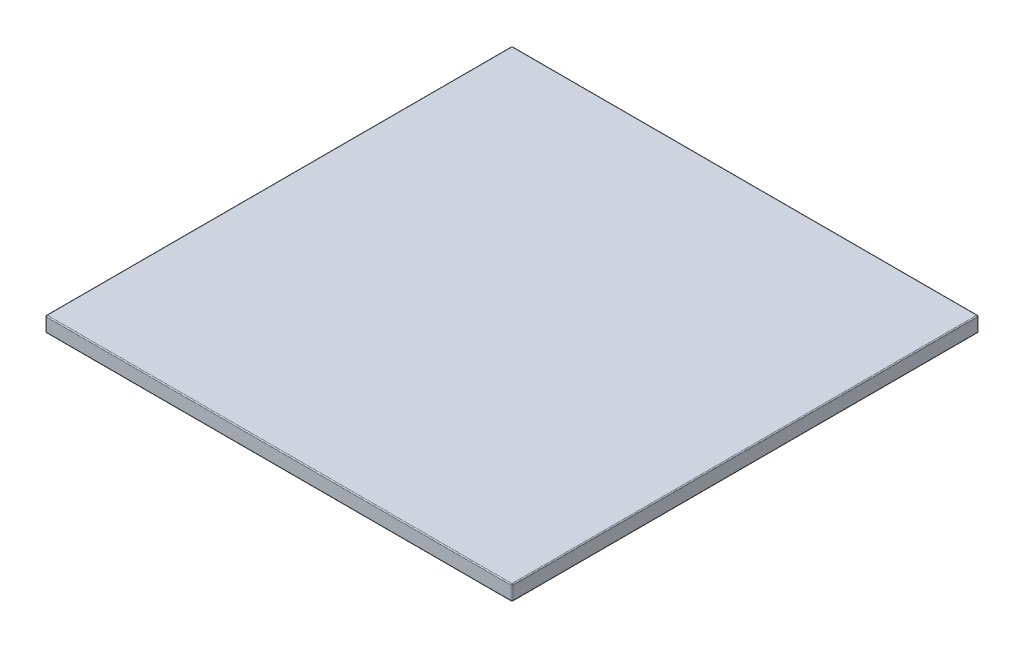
ISO-10303-21;
HEADER;
FILE_DESCRIPTION(('STEP AP214'),'2;1');
FILE_NAME('part.step','',(''),(''),'','','');
FILE_SCHEMA(('AUTOMOTIVE_DESIGN { 1 0 10303 214 1 1 1 1 }'));
ENDSEC;
DATA;
#1=APPLICATION_CONTEXT('core data for automotive mechanical design processes');
#2=APPLICATION_PROTOCOL_DEFINITION('international standard','automotive_design',2000,#1);
#3=PRODUCT_CONTEXT('',#1,'mechanical');
#4=PRODUCT('Part','Part','',(#3));
#5=PRODUCT_RELATED_PRODUCT_CATEGORY('part','',(#4));
#6=PRODUCT_DEFINITION_FORMATION('','',#4);
#7=PRODUCT_DEFINITION_CONTEXT('part definition',#1,'design');
#8=PRODUCT_DEFINITION('design','',#6,#7);
#9=PRODUCT_DEFINITION_SHAPE('','',#8);
#10=(LENGTH_UNIT() NAMED_UNIT(*) SI_UNIT(.MILLI.,.METRE.));
#11=(NAMED_UNIT(*) PLANE_ANGLE_UNIT() SI_UNIT($,.RADIAN.));
#12=(NAMED_UNIT(*) SI_UNIT($,.STERADIAN.) SOLID_ANGLE_UNIT());
#13=UNCERTAINTY_MEASURE_WITH_UNIT(LENGTH_MEASURE(1.E-05),#10,'distance_accuracy_value','');
#14=(GEOMETRIC_REPRESENTATION_CONTEXT(3) GLOBAL_UNCERTAINTY_ASSIGNED_CONTEXT((#13)) GLOBAL_UNIT_ASSIGNED_CONTEXT((#10,
#11,#12)) REPRESENTATION_CONTEXT('',''));
#15=CARTESIAN_POINT('',(0.,0.,0.));
#16=DIRECTION('',(0.,0.,1.));
#17=DIRECTION('',(1.,0.,0.));
#18=AXIS2_PLACEMENT_3D('',#15,#16,#17);
#19=CARTESIAN_POINT('',(0.,39.5,0.));
#20=DIRECTION('',(1.,0.,0.));
#21=DIRECTION('',(0.,0.,-1.));
#22=AXIS2_PLACEMENT_3D('',#19,#20,#21);
#23=PLANE('',#22);
#24=DIRECTION('',(0.,-1.,0.));
#25=VECTOR('',#24,1.);
#26=CARTESIAN_POINT('',(0.,39.5,-1216.66));
#27=LINE('',#26,#25);
#28=CARTESIAN_POINT('',(0.,36.96,-1216.66));
#29=VERTEX_POINT('',#28);
#30=CARTESIAN_POINT('',(0.,2.54,-1216.66));
#31=VERTEX_POINT('',#30);
#32=EDGE_CURVE('E136',#29,#31,#27,.T.);
#33=ORIENTED_EDGE('',*,*,#32,.T.);
#34=DIRECTION('',(0.,0.,1.));
#35=VECTOR('',#34,1.);
#36=CARTESIAN_POINT('',(0.,2.54,0.));
#37=LINE('',#36,#35);
#38=CARTESIAN_POINT('',(0.,2.54,-2.54));
#39=VERTEX_POINT('',#38);
#40=EDGE_CURVE('E177',#31,#39,#37,.T.);
#41=ORIENTED_EDGE('',*,*,#40,.T.);
#42=DIRECTION('',(0.,-1.,0.));
#43=VECTOR('',#42,1.);
#44=CARTESIAN_POINT('',(0.,39.5,-2.54));
#45=LINE('',#44,#43);
#46=CARTESIAN_POINT('',(0.,36.96,-2.54));
#47=VERTEX_POINT('',#46);
#48=EDGE_CURVE('E174',#39,#47,#45,.F.);
#49=ORIENTED_EDGE('',*,*,#48,.T.);
#50=DIRECTION('',(0.,0.,1.));
#51=VECTOR('',#50,1.);
#52=CARTESIAN_POINT('',(0.,36.96,0.));
#53=LINE('',#52,#51);
#54=EDGE_CURVE('E172',#47,#29,#53,.F.);
#55=ORIENTED_EDGE('',*,*,#54,.T.);
#56=EDGE_LOOP('',(#33,#41,#49,#55));
#57=FACE_BOUND('',#56,.T.);
#58=ADVANCED_FACE('F31',(#57),#23,.F.);
#59=CARTESIAN_POINT('',(0.,39.5,0.));
#60=DIRECTION('',(0.,0.,-1.));
#61=DIRECTION('',(-1.,0.,0.));
#62=AXIS2_PLACEMENT_3D('',#59,#60,#61);
#63=PLANE('',#62);
#64=DIRECTION('',(0.,-1.,0.));
#65=VECTOR('',#64,1.);
#66=CARTESIAN_POINT('',(2.54,39.5,0.));
#67=LINE('',#66,#65);
#68=CARTESIAN_POINT('',(2.54,36.96,0.));
#69=VERTEX_POINT('',#68);
#70=CARTESIAN_POINT('',(2.54,2.54,0.));
#71=VERTEX_POINT('',#70);
#72=EDGE_CURVE('E183',#69,#71,#67,.T.);
#73=ORIENTED_EDGE('',*,*,#72,.T.);
#74=DIRECTION('',(1.,0.,0.));
#75=VECTOR('',#74,1.);
#76=CARTESIAN_POINT('',(1219.2,2.54,0.));
#77=LINE('',#76,#75);
#78=CARTESIAN_POINT('',(1216.66,2.54,0.));
#79=VERTEX_POINT('',#78);
#80=EDGE_CURVE('E186',#71,#79,#77,.T.);
#81=ORIENTED_EDGE('',*,*,#80,.T.);
#82=DIRECTION('',(0.,-1.,0.));
#83=VECTOR('',#82,1.);
#84=CARTESIAN_POINT('',(1216.66,39.5,0.));
#85=LINE('',#84,#83);
#86=CARTESIAN_POINT('',(1216.66,36.96,0.));
#87=VERTEX_POINT('',#86);
#88=EDGE_CURVE('E181',#79,#87,#85,.F.);
#89=ORIENTED_EDGE('',*,*,#88,.T.);
#90=DIRECTION('',(1.,0.,0.));
#91=VECTOR('',#90,1.);
#92=CARTESIAN_POINT('',(0.,36.96,0.));
#93=LINE('',#92,#91);
#94=EDGE_CURVE('E179',#87,#69,#93,.F.);
#95=ORIENTED_EDGE('',*,*,#94,.T.);
#96=EDGE_LOOP('',(#73,#81,#89,#95));
#97=FACE_BOUND('',#96,.T.);
#98=ADVANCED_FACE('F307',(#97),#63,.F.);
#99=CARTESIAN_POINT('',(1219.2,39.5,0.));
#100=DIRECTION('',(-1.,0.,0.));
#101=DIRECTION('',(0.,0.,1.));
#102=AXIS2_PLACEMENT_3D('',#99,#100,#101);
#103=PLANE('',#102);
#104=DIRECTION('',(0.,-1.,0.));
#105=VECTOR('',#104,1.);
#106=CARTESIAN_POINT('',(1219.2,39.5,-2.54));
#107=LINE('',#106,#105);
#108=CARTESIAN_POINT('',(1219.2,36.96,-2.54));
#109=VERTEX_POINT('',#108);
#110=CARTESIAN_POINT('',(1219.2,2.54,-2.54));
#111=VERTEX_POINT('',#110);
#112=EDGE_CURVE('E165',#109,#111,#107,.T.);
#113=ORIENTED_EDGE('',*,*,#112,.T.);
#114=DIRECTION('',(0.,0.,-1.));
#115=VECTOR('',#114,1.);
#116=CARTESIAN_POINT('',(1219.2,2.54,-1219.2));
#117=LINE('',#116,#115);
#118=CARTESIAN_POINT('',(1219.2,2.54,-1216.66));
#119=VERTEX_POINT('',#118);
#120=EDGE_CURVE('E170',#111,#119,#117,.T.);
#121=ORIENTED_EDGE('',*,*,#120,.T.);
#122=DIRECTION('',(0.,-1.,0.));
#123=VECTOR('',#122,1.);
#124=CARTESIAN_POINT('',(1219.2,39.5,-1216.66));
#125=LINE('',#124,#123);
#126=CARTESIAN_POINT('',(1219.2,36.96,-1216.66));
#127=VERTEX_POINT('',#126);
#128=EDGE_CURVE('E167',#119,#127,#125,.F.);
#129=ORIENTED_EDGE('',*,*,#128,.T.);
#130=DIRECTION('',(0.,0.,-1.));
#131=VECTOR('',#130,1.);
#132=CARTESIAN_POINT('',(1219.2,36.96,0.));
#133=LINE('',#132,#131);
#134=EDGE_CURVE('E163',#127,#109,#133,.F.);
#135=ORIENTED_EDGE('',*,*,#134,.T.);
#136=EDGE_LOOP('',(#113,#121,#129,#135));
#137=FACE_BOUND('',#136,.T.);
#138=ADVANCED_FACE('F301',(#137),#103,.F.);
#139=CARTESIAN_POINT('',(0.,39.5,-1219.2));
#140=DIRECTION('',(0.,0.,1.));
#141=DIRECTION('',(1.,0.,0.));
#142=AXIS2_PLACEMENT_3D('',#139,#140,#141);
#143=PLANE('',#142);
#144=DIRECTION('',(0.,-1.,0.));
#145=VECTOR('',#144,1.);
#146=CARTESIAN_POINT('',(1216.66,39.5,-1219.2));
#147=LINE('',#146,#145);
#148=CARTESIAN_POINT('',(1216.66,36.96,-1219.2));
#149=VERTEX_POINT('',#148);
#150=CARTESIAN_POINT('',(1216.66,2.54,-1219.2));
#151=VERTEX_POINT('',#150);
#152=EDGE_CURVE('E128',#149,#151,#147,.T.);
#153=ORIENTED_EDGE('',*,*,#152,.T.);
#154=DIRECTION('',(-1.,0.,0.));
#155=VECTOR('',#154,1.);
#156=CARTESIAN_POINT('',(0.,2.54,-1219.2));
#157=LINE('',#156,#155);
#158=CARTESIAN_POINT('',(2.54,2.54,-1219.2));
#159=VERTEX_POINT('',#158);
#160=EDGE_CURVE('E124',#151,#159,#157,.T.);
#161=ORIENTED_EDGE('',*,*,#160,.T.);
#162=DIRECTION('',(0.,-1.,0.));
#163=VECTOR('',#162,1.);
#164=CARTESIAN_POINT('',(2.54,39.5,-1219.2));
#165=LINE('',#164,#163);
#166=CARTESIAN_POINT('',(2.54,36.96,-1219.2));
#167=VERTEX_POINT('',#166);
#168=EDGE_CURVE('E116',#159,#167,#165,.F.);
#169=ORIENTED_EDGE('',*,*,#168,.T.);
#170=DIRECTION('',(-1.,0.,0.));
#171=VECTOR('',#170,1.);
#172=CARTESIAN_POINT('',(0.,36.96,-1219.2));
#173=LINE('',#172,#171);
#174=EDGE_CURVE('E121',#167,#149,#173,.F.);
#175=ORIENTED_EDGE('',*,*,#174,.T.);
#176=EDGE_LOOP('',(#153,#161,#169,#175));
#177=FACE_BOUND('',#176,.T.);
#178=ADVANCED_FACE('F119',(#177),#143,.F.);
#179=CARTESIAN_POINT('',(0.,39.5,-1219.2));
#180=DIRECTION('',(0.,-1.,0.));
#181=DIRECTION('',(0.,0.,-1.));
#182=AXIS2_PLACEMENT_3D('',#179,#180,#181);
#183=PLANE('',#182);
#184=DIRECTION('',(0.,0.,-1.));
#185=VECTOR('',#184,1.);
#186=CARTESIAN_POINT('',(1216.66,39.5,-1219.2));
#187=LINE('',#186,#185);
#188=CARTESIAN_POINT('',(1216.66,39.5,-2.53999999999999));
#189=VERTEX_POINT('',#188);
#190=CARTESIAN_POINT('',(1216.66,39.5,-1216.66));
#191=VERTEX_POINT('',#190);
#192=EDGE_CURVE('E38',#189,#191,#187,.T.);
#193=ORIENTED_EDGE('',*,*,#192,.T.);
#194=DIRECTION('',(-1.,0.,0.));
#195=VECTOR('',#194,1.);
#196=CARTESIAN_POINT('',(0.,39.5,-1216.66));
#197=LINE('',#196,#195);
#198=CARTESIAN_POINT('',(2.54,39.5,-1216.66));
#199=VERTEX_POINT('',#198);
#200=EDGE_CURVE('E11',#191,#199,#197,.T.);
#201=ORIENTED_EDGE('',*,*,#200,.T.);
#202=DIRECTION('',(0.,0.,1.));
#203=VECTOR('',#202,1.);
#204=CARTESIAN_POINT('',(2.54,39.5,-1219.2));
#205=LINE('',#204,#203);
#206=CARTESIAN_POINT('',(2.54,39.5,-2.53999999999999));
#207=VERTEX_POINT('',#206);
#208=EDGE_CURVE('E197',#199,#207,#205,.T.);
#209=ORIENTED_EDGE('',*,*,#208,.T.);
#210=DIRECTION('',(1.,0.,0.));
#211=VECTOR('',#210,1.);
#212=CARTESIAN_POINT('',(0.,39.5,-2.53999999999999));
#213=LINE('',#212,#211);
#214=EDGE_CURVE('E48',#207,#189,#213,.T.);
#215=ORIENTED_EDGE('',*,*,#214,.T.);
#216=EDGE_LOOP('',(#193,#201,#209,#215));
#217=FACE_BOUND('',#216,.T.);
#218=ADVANCED_FACE('F200',(#217),#183,.F.);
#219=CARTESIAN_POINT('',(0.,0.,-1219.2));
#220=DIRECTION('',(0.,-1.,0.));
#221=DIRECTION('',(0.,0.,-1.));
#222=AXIS2_PLACEMENT_3D('',#219,#220,#221);
#223=PLANE('',#222);
#224=DIRECTION('',(0.,0.,-1.));
#225=VECTOR('',#224,1.);
#226=CARTESIAN_POINT('',(1216.66,0.,0.));
#227=LINE('',#226,#225);
#228=CARTESIAN_POINT('',(1216.66,0.,-1216.66));
#229=VERTEX_POINT('',#228);
#230=CARTESIAN_POINT('',(1216.66,0.,-2.54));
#231=VERTEX_POINT('',#230);
#232=EDGE_CURVE('E192',#229,#231,#227,.F.);
#233=ORIENTED_EDGE('',*,*,#232,.T.);
#234=DIRECTION('',(1.,0.,0.));
#235=VECTOR('',#234,1.);
#236=CARTESIAN_POINT('',(0.,0.,-2.54));
#237=LINE('',#236,#235);
#238=CARTESIAN_POINT('',(2.54,0.,-2.54));
#239=VERTEX_POINT('',#238);
#240=EDGE_CURVE('E194',#231,#239,#237,.F.);
#241=ORIENTED_EDGE('',*,*,#240,.T.);
#242=DIRECTION('',(0.,0.,1.));
#243=VECTOR('',#242,1.);
#244=CARTESIAN_POINT('',(2.54,0.,-1219.2));
#245=LINE('',#244,#243);
#246=CARTESIAN_POINT('',(2.54,0.,-1216.66));
#247=VERTEX_POINT('',#246);
#248=EDGE_CURVE('E188',#239,#247,#245,.F.);
#249=ORIENTED_EDGE('',*,*,#248,.T.);
#250=DIRECTION('',(-1.,0.,0.));
#251=VECTOR('',#250,1.);
#252=CARTESIAN_POINT('',(1219.2,0.,-1216.66));
#253=LINE('',#252,#251);
#254=EDGE_CURVE('E190',#247,#229,#253,.F.);
#255=ORIENTED_EDGE('',*,*,#254,.T.);
#256=EDGE_LOOP('',(#233,#241,#249,#255));
#257=FACE_BOUND('',#256,.T.);
#258=ADVANCED_FACE('F282',(#257),#223,.T.);
#259=CARTESIAN_POINT('',(2.54,39.5,-2.54));
#260=DIRECTION('',(0.,-1.,0.));
#261=DIRECTION('',(0.,0.,-1.));
#262=AXIS2_PLACEMENT_3D('',#259,#260,#261);
#263=CYLINDRICAL_SURFACE('',#262,2.54);
#264=CARTESIAN_POINT('',(2.54,36.96,-2.54));
#265=DIRECTION('',(0.,1.,0.));
#266=DIRECTION('',(0.,0.,1.));
#267=AXIS2_PLACEMENT_3D('',#264,#265,#266);
#268=CIRCLE('',#267,2.54);
#269=EDGE_CURVE('E154',#47,#69,#268,.T.);
#270=ORIENTED_EDGE('',*,*,#269,.F.);
#271=ORIENTED_EDGE('',*,*,#48,.F.);
#272=CARTESIAN_POINT('',(2.54,2.54,-2.54));
#273=DIRECTION('',(0.,-1.,0.));
#274=DIRECTION('',(0.,0.,-1.));
#275=AXIS2_PLACEMENT_3D('',#272,#273,#274);
#276=CIRCLE('',#275,2.54);
#277=EDGE_CURVE('E157',#71,#39,#276,.T.);
#278=ORIENTED_EDGE('',*,*,#277,.F.);
#279=ORIENTED_EDGE('',*,*,#72,.F.);
#280=EDGE_LOOP('',(#270,#271,#278,#279));
#281=FACE_BOUND('',#280,.T.);
#282=ADVANCED_FACE('F308',(#281),#263,.T.);
#283=CARTESIAN_POINT('',(2.54,36.96,-2.54));
#284=DIRECTION('',(0.,0.,1.));
#285=DIRECTION('',(1.,0.,0.));
#286=AXIS2_PLACEMENT_3D('',#283,#284,#285);
#287=SPHERICAL_SURFACE('',#286,2.54);
#288=CARTESIAN_POINT('',(2.54,36.96,-2.53999999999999));
#289=DIRECTION('',(0.,0.,1.));
#290=DIRECTION('',(1.,0.,0.));
#291=AXIS2_PLACEMENT_3D('',#288,#289,#290);
#292=CIRCLE('',#291,2.54);
#293=EDGE_CURVE('E204',#47,#207,#292,.F.);
#294=ORIENTED_EDGE('',*,*,#293,.F.);
#295=ORIENTED_EDGE('',*,*,#269,.T.);
#296=CARTESIAN_POINT('',(2.54,36.96,-2.54));
#297=DIRECTION('',(-1.,0.,0.));
#298=DIRECTION('',(0.,0.,1.));
#299=AXIS2_PLACEMENT_3D('',#296,#297,#298);
#300=CIRCLE('',#299,2.54);
#301=EDGE_CURVE('E208',#207,#69,#300,.F.);
#302=ORIENTED_EDGE('',*,*,#301,.F.);
#303=EDGE_LOOP('',(#294,#295,#302));
#304=FACE_BOUND('',#303,.T.);
#305=ADVANCED_FACE('F212',(#304),#287,.T.);
#306=CARTESIAN_POINT('',(2.54,2.54,-2.54));
#307=DIRECTION('',(0.,0.,1.));
#308=DIRECTION('',(1.,0.,0.));
#309=AXIS2_PLACEMENT_3D('',#306,#307,#308);
#310=SPHERICAL_SURFACE('',#309,2.54);
#311=CARTESIAN_POINT('',(2.54,2.54,-2.54));
#312=DIRECTION('',(-1.,0.,0.));
#313=DIRECTION('',(0.,0.,1.));
#314=AXIS2_PLACEMENT_3D('',#311,#312,#313);
#315=CIRCLE('',#314,2.54);
#316=EDGE_CURVE('E263',#71,#239,#315,.F.);
#317=ORIENTED_EDGE('',*,*,#316,.F.);
#318=ORIENTED_EDGE('',*,*,#277,.T.);
#319=CARTESIAN_POINT('',(2.54,2.54,-2.54));
#320=DIRECTION('',(0.,0.,1.));
#321=DIRECTION('',(1.,0.,0.));
#322=AXIS2_PLACEMENT_3D('',#319,#320,#321);
#323=CIRCLE('',#322,2.54);
#324=EDGE_CURVE('E209',#239,#39,#323,.F.);
#325=ORIENTED_EDGE('',*,*,#324,.F.);
#326=EDGE_LOOP('',(#317,#318,#325));
#327=FACE_BOUND('',#326,.T.);
#328=ADVANCED_FACE('F272',(#327),#310,.T.);
#329=CARTESIAN_POINT('',(0.,36.96,-2.53999999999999));
#330=DIRECTION('',(1.,0.,0.));
#331=DIRECTION('',(0.,0.,-1.));
#332=AXIS2_PLACEMENT_3D('',#329,#330,#331);
#333=CYLINDRICAL_SURFACE('',#332,2.54);
#334=ORIENTED_EDGE('',*,*,#301,.T.);
#335=ORIENTED_EDGE('',*,*,#94,.F.);
#336=CARTESIAN_POINT('',(1216.66,36.96,-2.53999999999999));
#337=DIRECTION('',(1.,0.,0.));
#338=DIRECTION('',(0.,0.,-1.));
#339=AXIS2_PLACEMENT_3D('',#336,#337,#338);
#340=CIRCLE('',#339,2.54);
#341=EDGE_CURVE('E219',#189,#87,#340,.T.);
#342=ORIENTED_EDGE('',*,*,#341,.F.);
#343=ORIENTED_EDGE('',*,*,#214,.F.);
#344=EDGE_LOOP('',(#334,#335,#342,#343));
#345=FACE_BOUND('',#344,.T.);
#346=ADVANCED_FACE('F217',(#345),#333,.T.);
#347=CARTESIAN_POINT('',(2.54,36.96,-1219.2));
#348=DIRECTION('',(0.,0.,1.));
#349=DIRECTION('',(1.,0.,0.));
#350=AXIS2_PLACEMENT_3D('',#347,#348,#349);
#351=CYLINDRICAL_SURFACE('',#350,2.54);
#352=ORIENTED_EDGE('',*,*,#293,.T.);
#353=ORIENTED_EDGE('',*,*,#208,.F.);
#354=CARTESIAN_POINT('',(2.54,36.96,-1216.66));
#355=DIRECTION('',(0.,0.,-1.));
#356=DIRECTION('',(-1.,0.,0.));
#357=AXIS2_PLACEMENT_3D('',#354,#355,#356);
#358=CIRCLE('',#357,2.54);
#359=EDGE_CURVE('E140',#29,#199,#358,.T.);
#360=ORIENTED_EDGE('',*,*,#359,.F.);
#361=ORIENTED_EDGE('',*,*,#54,.F.);
#362=EDGE_LOOP('',(#352,#353,#360,#361));
#363=FACE_BOUND('',#362,.T.);
#364=ADVANCED_FACE('F206',(#363),#351,.T.);
#365=CARTESIAN_POINT('',(2.54,39.5,-1216.66));
#366=DIRECTION('',(0.,-1.,0.));
#367=DIRECTION('',(0.,0.,-1.));
#368=AXIS2_PLACEMENT_3D('',#365,#366,#367);
#369=CYLINDRICAL_SURFACE('',#368,2.54);
#370=CARTESIAN_POINT('',(2.54,2.54,-1216.66));
#371=DIRECTION('',(0.,-1.,0.));
#372=DIRECTION('',(0.,0.,-1.));
#373=AXIS2_PLACEMENT_3D('',#370,#371,#372);
#374=CIRCLE('',#373,2.54);
#375=EDGE_CURVE('E141',#31,#159,#374,.T.);
#376=ORIENTED_EDGE('',*,*,#375,.F.);
#377=ORIENTED_EDGE('',*,*,#32,.F.);
#378=CARTESIAN_POINT('',(2.54,36.96,-1216.66));
#379=DIRECTION('',(0.,1.,0.));
#380=DIRECTION('',(0.,0.,1.));
#381=AXIS2_PLACEMENT_3D('',#378,#379,#380);
#382=CIRCLE('',#381,2.54);
#383=EDGE_CURVE('E132',#167,#29,#382,.T.);
#384=ORIENTED_EDGE('',*,*,#383,.F.);
#385=ORIENTED_EDGE('',*,*,#168,.F.);
#386=EDGE_LOOP('',(#376,#377,#384,#385));
#387=FACE_BOUND('',#386,.T.);
#388=ADVANCED_FACE('F134',(#387),#369,.T.);
#389=CARTESIAN_POINT('',(2.54,2.54,0.));
#390=DIRECTION('',(0.,0.,-1.));
#391=DIRECTION('',(-1.,0.,0.));
#392=AXIS2_PLACEMENT_3D('',#389,#390,#391);
#393=CYLINDRICAL_SURFACE('',#392,2.54);
#394=ORIENTED_EDGE('',*,*,#324,.T.);
#395=ORIENTED_EDGE('',*,*,#40,.F.);
#396=CARTESIAN_POINT('',(2.54,2.54,-1216.66));
#397=DIRECTION('',(0.,0.,-1.));
#398=DIRECTION('',(-1.,0.,0.));
#399=AXIS2_PLACEMENT_3D('',#396,#397,#398);
#400=CIRCLE('',#399,2.54);
#401=EDGE_CURVE('E258',#247,#31,#400,.T.);
#402=ORIENTED_EDGE('',*,*,#401,.F.);
#403=ORIENTED_EDGE('',*,*,#248,.F.);
#404=EDGE_LOOP('',(#394,#395,#402,#403));
#405=FACE_BOUND('',#404,.T.);
#406=ADVANCED_FACE('F278',(#405),#393,.T.);
#407=CARTESIAN_POINT('',(0.,2.54,-2.54));
#408=DIRECTION('',(-1.,0.,0.));
#409=DIRECTION('',(0.,0.,1.));
#410=AXIS2_PLACEMENT_3D('',#407,#408,#409);
#411=CYLINDRICAL_SURFACE('',#410,2.54);
#412=ORIENTED_EDGE('',*,*,#316,.T.);
#413=ORIENTED_EDGE('',*,*,#240,.F.);
#414=CARTESIAN_POINT('',(1216.66,2.54,-2.54));
#415=DIRECTION('',(1.,0.,0.));
#416=DIRECTION('',(0.,0.,-1.));
#417=AXIS2_PLACEMENT_3D('',#414,#415,#416);
#418=CIRCLE('',#417,2.54);
#419=EDGE_CURVE('E255',#79,#231,#418,.T.);
#420=ORIENTED_EDGE('',*,*,#419,.F.);
#421=ORIENTED_EDGE('',*,*,#80,.F.);
#422=EDGE_LOOP('',(#412,#413,#420,#421));
#423=FACE_BOUND('',#422,.T.);
#424=ADVANCED_FACE('F288',(#423),#411,.T.);
#425=CARTESIAN_POINT('',(1216.66,39.5,-2.54));
#426=DIRECTION('',(0.,-1.,0.));
#427=DIRECTION('',(0.,0.,-1.));
#428=AXIS2_PLACEMENT_3D('',#425,#426,#427);
#429=CYLINDRICAL_SURFACE('',#428,2.54);
#430=CARTESIAN_POINT('',(1216.66,36.96,-2.54));
#431=DIRECTION('',(0.,1.,0.));
#432=DIRECTION('',(0.,0.,1.));
#433=AXIS2_PLACEMENT_3D('',#430,#431,#432);
#434=CIRCLE('',#433,2.54);
#435=EDGE_CURVE('E224',#87,#109,#434,.T.);
#436=ORIENTED_EDGE('',*,*,#435,.F.);
#437=ORIENTED_EDGE('',*,*,#88,.F.);
#438=CARTESIAN_POINT('',(1216.66,2.54,-2.54));
#439=DIRECTION('',(0.,-1.,0.));
#440=DIRECTION('',(0.,0.,-1.));
#441=AXIS2_PLACEMENT_3D('',#438,#439,#440);
#442=CIRCLE('',#441,2.54);
#443=EDGE_CURVE('E230',#111,#79,#442,.T.);
#444=ORIENTED_EDGE('',*,*,#443,.F.);
#445=ORIENTED_EDGE('',*,*,#112,.F.);
#446=EDGE_LOOP('',(#436,#437,#444,#445));
#447=FACE_BOUND('',#446,.T.);
#448=ADVANCED_FACE('F305',(#447),#429,.T.);
#449=CARTESIAN_POINT('',(1216.66,36.96,-2.54));
#450=DIRECTION('',(0.,0.,1.));
#451=DIRECTION('',(1.,0.,0.));
#452=AXIS2_PLACEMENT_3D('',#449,#450,#451);
#453=SPHERICAL_SURFACE('',#452,2.54);
#454=ORIENTED_EDGE('',*,*,#341,.T.);
#455=ORIENTED_EDGE('',*,*,#435,.T.);
#456=CARTESIAN_POINT('',(1216.66,36.96,-2.54));
#457=DIRECTION('',(0.,0.,1.));
#458=DIRECTION('',(0.,-1.,0.));
#459=AXIS2_PLACEMENT_3D('',#456,#457,#458);
#460=CIRCLE('',#459,2.54);
#461=EDGE_CURVE('E147',#189,#109,#460,.F.);
#462=ORIENTED_EDGE('',*,*,#461,.F.);
#463=EDGE_LOOP('',(#454,#455,#462));
#464=FACE_BOUND('',#463,.T.);
#465=ADVANCED_FACE('F227',(#464),#453,.T.);
#466=CARTESIAN_POINT('',(2.54,36.96,-1216.66));
#467=DIRECTION('',(0.,0.,1.));
#468=DIRECTION('',(1.,0.,0.));
#469=AXIS2_PLACEMENT_3D('',#466,#467,#468);
#470=SPHERICAL_SURFACE('',#469,2.54);
#471=ORIENTED_EDGE('',*,*,#383,.T.);
#472=ORIENTED_EDGE('',*,*,#359,.T.);
#473=CARTESIAN_POINT('',(2.54,36.96,-1216.66));
#474=DIRECTION('',(-1.,0.,0.));
#475=DIRECTION('',(0.,0.,1.));
#476=AXIS2_PLACEMENT_3D('',#473,#474,#475);
#477=CIRCLE('',#476,2.54);
#478=EDGE_CURVE('E143',#167,#199,#477,.F.);
#479=ORIENTED_EDGE('',*,*,#478,.F.);
#480=EDGE_LOOP('',(#471,#472,#479));
#481=FACE_BOUND('',#480,.T.);
#482=ADVANCED_FACE('F144',(#481),#470,.T.);
#483=CARTESIAN_POINT('',(2.54,2.54,-1216.66));
#484=DIRECTION('',(0.,0.,1.));
#485=DIRECTION('',(1.,0.,0.));
#486=AXIS2_PLACEMENT_3D('',#483,#484,#485);
#487=SPHERICAL_SURFACE('',#486,2.54);
#488=ORIENTED_EDGE('',*,*,#401,.T.);
#489=ORIENTED_EDGE('',*,*,#375,.T.);
#490=CARTESIAN_POINT('',(2.54,2.54,-1216.66));
#491=DIRECTION('',(-1.,0.,0.));
#492=DIRECTION('',(0.,0.,1.));
#493=AXIS2_PLACEMENT_3D('',#490,#491,#492);
#494=CIRCLE('',#493,2.54);
#495=EDGE_CURVE('E148',#247,#159,#494,.F.);
#496=ORIENTED_EDGE('',*,*,#495,.F.);
#497=EDGE_LOOP('',(#488,#489,#496));
#498=FACE_BOUND('',#497,.T.);
#499=ADVANCED_FACE('F347',(#498),#487,.T.);
#500=CARTESIAN_POINT('',(1216.66,2.54,-2.54));
#501=DIRECTION('',(0.,0.,1.));
#502=DIRECTION('',(1.,0.,0.));
#503=AXIS2_PLACEMENT_3D('',#500,#501,#502);
#504=SPHERICAL_SURFACE('',#503,2.54);
#505=ORIENTED_EDGE('',*,*,#443,.T.);
#506=ORIENTED_EDGE('',*,*,#419,.T.);
#507=CARTESIAN_POINT('',(1216.66,2.54,-2.54));
#508=DIRECTION('',(0.,0.,1.));
#509=DIRECTION('',(1.,0.,0.));
#510=AXIS2_PLACEMENT_3D('',#507,#508,#509);
#511=CIRCLE('',#510,2.54);
#512=EDGE_CURVE('E237',#111,#231,#511,.F.);
#513=ORIENTED_EDGE('',*,*,#512,.F.);
#514=EDGE_LOOP('',(#505,#506,#513));
#515=FACE_BOUND('',#514,.T.);
#516=ADVANCED_FACE('F291',(#515),#504,.T.);
#517=CARTESIAN_POINT('',(1216.66,36.96,-1219.2));
#518=DIRECTION('',(0.,0.,-1.));
#519=DIRECTION('',(-1.,0.,0.));
#520=AXIS2_PLACEMENT_3D('',#517,#518,#519);
#521=CYLINDRICAL_SURFACE('',#520,2.54);
#522=ORIENTED_EDGE('',*,*,#461,.T.);
#523=ORIENTED_EDGE('',*,*,#134,.F.);
#524=CARTESIAN_POINT('',(1216.66,36.96,-1216.66));
#525=DIRECTION('',(0.,0.,-1.));
#526=DIRECTION('',(-1.,0.,0.));
#527=AXIS2_PLACEMENT_3D('',#524,#525,#526);
#528=CIRCLE('',#527,2.54);
#529=EDGE_CURVE('E235',#191,#127,#528,.T.);
#530=ORIENTED_EDGE('',*,*,#529,.F.);
#531=ORIENTED_EDGE('',*,*,#192,.F.);
#532=EDGE_LOOP('',(#522,#523,#530,#531));
#533=FACE_BOUND('',#532,.T.);
#534=ADVANCED_FACE('F233',(#533),#521,.T.);
#535=CARTESIAN_POINT('',(0.,36.96,-1216.66));
#536=DIRECTION('',(-1.,0.,0.));
#537=DIRECTION('',(0.,0.,1.));
#538=AXIS2_PLACEMENT_3D('',#535,#536,#537);
#539=CYLINDRICAL_SURFACE('',#538,2.54);
#540=ORIENTED_EDGE('',*,*,#478,.T.);
#541=ORIENTED_EDGE('',*,*,#200,.F.);
#542=CARTESIAN_POINT('',(1216.66,36.96,-1216.66));
#543=DIRECTION('',(1.,0.,0.));
#544=DIRECTION('',(0.,0.,-1.));
#545=AXIS2_PLACEMENT_3D('',#542,#543,#544);
#546=CIRCLE('',#545,2.54);
#547=EDGE_CURVE('E152',#149,#191,#546,.T.);
#548=ORIENTED_EDGE('',*,*,#547,.F.);
#549=ORIENTED_EDGE('',*,*,#174,.F.);
#550=EDGE_LOOP('',(#540,#541,#548,#549));
#551=FACE_BOUND('',#550,.T.);
#552=ADVANCED_FACE('F150',(#551),#539,.T.);
#553=CARTESIAN_POINT('',(0.,2.54,-1216.66));
#554=DIRECTION('',(1.,0.,0.));
#555=DIRECTION('',(0.,0.,-1.));
#556=AXIS2_PLACEMENT_3D('',#553,#554,#555);
#557=CYLINDRICAL_SURFACE('',#556,2.54);
#558=ORIENTED_EDGE('',*,*,#495,.T.);
#559=ORIENTED_EDGE('',*,*,#160,.F.);
#560=CARTESIAN_POINT('',(1216.66,2.54,-1216.66));
#561=DIRECTION('',(1.,0.,0.));
#562=DIRECTION('',(0.,0.,-1.));
#563=AXIS2_PLACEMENT_3D('',#560,#561,#562);
#564=CIRCLE('',#563,2.54);
#565=EDGE_CURVE('E242',#229,#151,#564,.T.);
#566=ORIENTED_EDGE('',*,*,#565,.F.);
#567=ORIENTED_EDGE('',*,*,#254,.F.);
#568=EDGE_LOOP('',(#558,#559,#566,#567));
#569=FACE_BOUND('',#568,.T.);
#570=ADVANCED_FACE('F357',(#569),#557,.T.);
#571=CARTESIAN_POINT('',(1216.66,2.54,0.));
#572=DIRECTION('',(0.,0.,1.));
#573=DIRECTION('',(1.,0.,0.));
#574=AXIS2_PLACEMENT_3D('',#571,#572,#573);
#575=CYLINDRICAL_SURFACE('',#574,2.54);
#576=ORIENTED_EDGE('',*,*,#512,.T.);
#577=ORIENTED_EDGE('',*,*,#232,.F.);
#578=CARTESIAN_POINT('',(1216.66,2.54,-1216.66));
#579=DIRECTION('',(0.,0.,-1.));
#580=DIRECTION('',(-1.,0.,0.));
#581=AXIS2_PLACEMENT_3D('',#578,#579,#580);
#582=CIRCLE('',#581,2.54);
#583=EDGE_CURVE('E245',#119,#229,#582,.T.);
#584=ORIENTED_EDGE('',*,*,#583,.F.);
#585=ORIENTED_EDGE('',*,*,#120,.F.);
#586=EDGE_LOOP('',(#576,#577,#584,#585));
#587=FACE_BOUND('',#586,.T.);
#588=ADVANCED_FACE('F295',(#587),#575,.T.);
#589=CARTESIAN_POINT('',(1216.66,36.96,-1216.66));
#590=DIRECTION('',(0.,0.,1.));
#591=DIRECTION('',(1.,0.,0.));
#592=AXIS2_PLACEMENT_3D('',#589,#590,#591);
#593=SPHERICAL_SURFACE('',#592,2.54);
#594=ORIENTED_EDGE('',*,*,#547,.T.);
#595=ORIENTED_EDGE('',*,*,#529,.T.);
#596=CARTESIAN_POINT('',(1216.66,36.96,-1216.66));
#597=DIRECTION('',(0.,1.,0.));
#598=DIRECTION('',(0.,0.,1.));
#599=AXIS2_PLACEMENT_3D('',#596,#597,#598);
#600=CIRCLE('',#599,2.54);
#601=EDGE_CURVE('E240',#149,#127,#600,.F.);
#602=ORIENTED_EDGE('',*,*,#601,.F.);
#603=EDGE_LOOP('',(#594,#595,#602));
#604=FACE_BOUND('',#603,.T.);
#605=ADVANCED_FACE('F239',(#604),#593,.T.);
#606=CARTESIAN_POINT('',(1216.66,2.54,-1216.66));
#607=DIRECTION('',(0.,0.,1.));
#608=DIRECTION('',(1.,0.,0.));
#609=AXIS2_PLACEMENT_3D('',#606,#607,#608);
#610=SPHERICAL_SURFACE('',#609,2.54);
#611=ORIENTED_EDGE('',*,*,#583,.T.);
#612=ORIENTED_EDGE('',*,*,#565,.T.);
#613=CARTESIAN_POINT('',(1216.66,2.54,-1216.66));
#614=DIRECTION('',(0.,-1.,0.));
#615=DIRECTION('',(0.,0.,-1.));
#616=AXIS2_PLACEMENT_3D('',#613,#614,#615);
#617=CIRCLE('',#616,2.54);
#618=EDGE_CURVE('E375',#119,#151,#617,.F.);
#619=ORIENTED_EDGE('',*,*,#618,.F.);
#620=EDGE_LOOP('',(#611,#612,#619));
#621=FACE_BOUND('',#620,.T.);
#622=ADVANCED_FACE('F365',(#621),#610,.T.);
#623=CARTESIAN_POINT('',(1216.66,39.5,-1216.66));
#624=DIRECTION('',(0.,-1.,0.));
#625=DIRECTION('',(0.,0.,-1.));
#626=AXIS2_PLACEMENT_3D('',#623,#624,#625);
#627=CYLINDRICAL_SURFACE('',#626,2.54);
#628=ORIENTED_EDGE('',*,*,#601,.T.);
#629=ORIENTED_EDGE('',*,*,#128,.F.);
#630=ORIENTED_EDGE('',*,*,#618,.T.);
#631=ORIENTED_EDGE('',*,*,#152,.F.);
#632=EDGE_LOOP('',(#628,#629,#630,#631));
#633=FACE_BOUND('',#632,.T.);
#634=ADVANCED_FACE('F368',(#633),#627,.T.);
#635=CLOSED_SHELL('',(#58,#98,#138,#178,#218,#258,#282,#305,#328,#346,#364,#388,#406,#424,#448,
#465,#482,#499,#516,#534,#552,#570,#588,#605,#622,#634));
#636=MANIFOLD_SOLID_BREP('B2',#635);
#637=ADVANCED_BREP_SHAPE_REPRESENTATION('',(#18,#636),#14);
#638=SHAPE_DEFINITION_REPRESENTATION(#9,#637);
ENDSEC;
END-ISO-10303-21;
